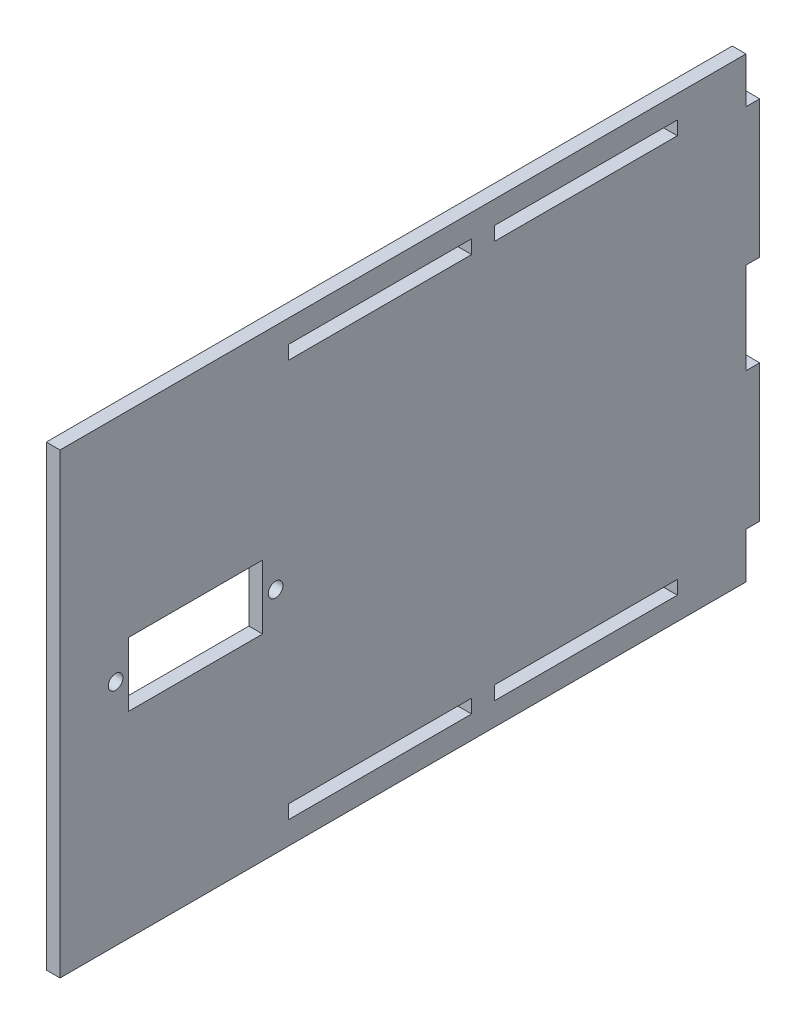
from build123d import *

# Parameters (mm, degrees)
ESQUISSE1_W             = 3
ESQUISSE1_H             = 100
BOSS_EXTRU_1_DEPTH      = 150
ESQUISSE2_W             = 3
ESQUISSE2_H             = 30
BOSS_EXTRU_2_DEPTH      = 3
ESQUISSE3_R             = 1.6
ESQUISSE3_W             = 29.3
ESQUISSE3_H             = 14
ENL_V_MAT_EXTRU_1_DEPTH = 159.142340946
ESQUISSE4_W             = 40
ESQUISSE4_H             = 3
ENL_V_MAT_EXTRU_2_DEPTH = 159.142340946


with BuildPart() as part:
    # Esquisse1 → Boss.-Extru.1 (new body)
    with BuildSketch(Plane.XY):
        with Locations((68.5, 0)):
            Rectangle(ESQUISSE1_W, ESQUISSE1_H)
    extrude(amount=BOSS_EXTRU_1_DEPTH)

    # Esquisse2 → Boss.-Extru.2 (add)
    with BuildSketch(Plane(origin=(0, 0, -3), x_dir=(-1, 0, 0), z_dir=(0, 0, -1))):
        with Locations((-68.5, 25)):
            Rectangle(ESQUISSE2_W, ESQUISSE2_H)
        with Locations((-68.5, -25)):
            Rectangle(ESQUISSE2_W, ESQUISSE2_H)
    extrude(amount=-BOSS_EXTRU_2_DEPTH)

    # Esquisse3 → Enl_v. mat.-Extru.1 (cut, through all)
    with BuildSketch(Plane(origin=(70, 0, 0), x_dir=(0, 0, -1), z_dir=(1, 0, 0))):
        with Locations((-137.85, 0)):
            Circle(ESQUISSE3_R)
        with Locations((-102.85, 0)):
            Circle(ESQUISSE3_R)
        with Locations((-120.35, 0)):
            Rectangle(ESQUISSE3_W, ESQUISSE3_H)
    extrude(amount=-ENL_V_MAT_EXTRU_1_DEPTH, mode=Mode.SUBTRACT)

    # Esquisse4 → Enl_v. mat.-Extru.2 (cut, through all)
    with BuildSketch(Plane(origin=(70, 0, 0), x_dir=(0, 0, -1), z_dir=(1, 0, 0))):
        with Locations((-80, -43.5)):
            Rectangle(ESQUISSE4_W, ESQUISSE4_H)
        with Locations((-80, 43.5)):
            Rectangle(ESQUISSE4_W, ESQUISSE4_H)
        with Locations((-35, -43.5)):
            Rectangle(ESQUISSE4_W, ESQUISSE4_H)
        with Locations((-35, 43.5)):
            Rectangle(ESQUISSE4_W, ESQUISSE4_H)
    extrude(amount=-ENL_V_MAT_EXTRU_2_DEPTH, mode=Mode.SUBTRACT)


solid = part.part
